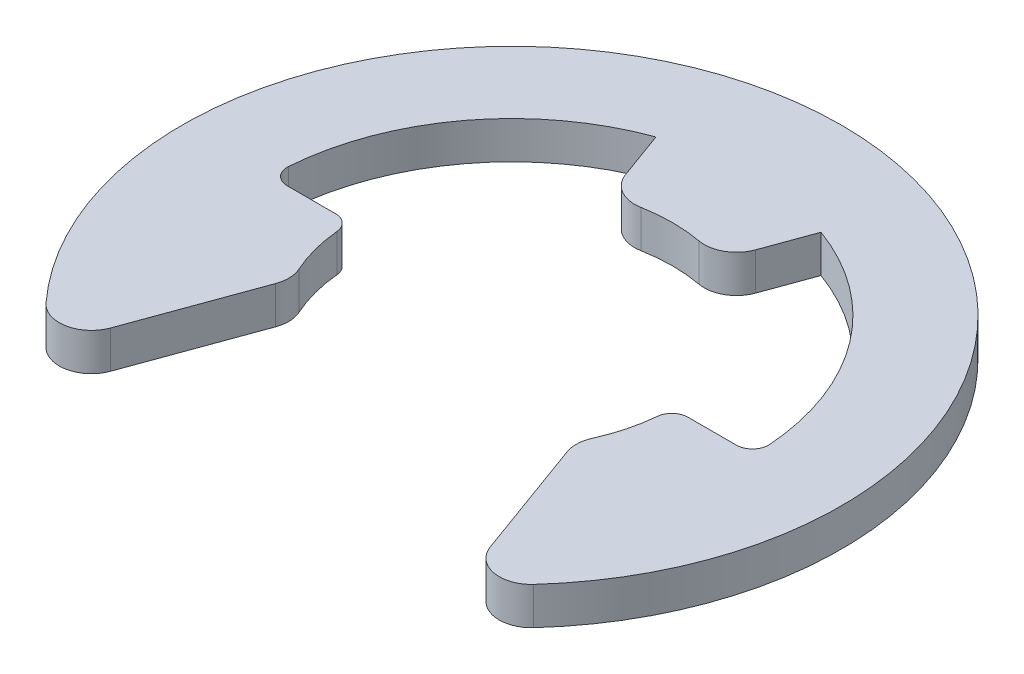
ISO-10303-21;
HEADER;
FILE_DESCRIPTION(('STEP AP214'),'2;1');
FILE_NAME('part.step','',(''),(''),'','','');
FILE_SCHEMA(('AUTOMOTIVE_DESIGN { 1 0 10303 214 1 1 1 1 }'));
ENDSEC;
DATA;
#1=APPLICATION_CONTEXT('core data for automotive mechanical design processes');
#2=APPLICATION_PROTOCOL_DEFINITION('international standard','automotive_design',2000,#1);
#3=PRODUCT_CONTEXT('',#1,'mechanical');
#4=PRODUCT('Part','Part','',(#3));
#5=PRODUCT_RELATED_PRODUCT_CATEGORY('part','',(#4));
#6=PRODUCT_DEFINITION_FORMATION('','',#4);
#7=PRODUCT_DEFINITION_CONTEXT('part definition',#1,'design');
#8=PRODUCT_DEFINITION('design','',#6,#7);
#9=PRODUCT_DEFINITION_SHAPE('','',#8);
#10=(LENGTH_UNIT() NAMED_UNIT(*) SI_UNIT(.MILLI.,.METRE.));
#11=(NAMED_UNIT(*) PLANE_ANGLE_UNIT() SI_UNIT($,.RADIAN.));
#12=(NAMED_UNIT(*) SI_UNIT($,.STERADIAN.) SOLID_ANGLE_UNIT());
#13=UNCERTAINTY_MEASURE_WITH_UNIT(LENGTH_MEASURE(1.E-05),#10,'distance_accuracy_value','');
#14=(GEOMETRIC_REPRESENTATION_CONTEXT(3) GLOBAL_UNCERTAINTY_ASSIGNED_CONTEXT((#13)) GLOBAL_UNIT_ASSIGNED_CONTEXT((#10,
#11,#12)) REPRESENTATION_CONTEXT('',''));
#15=CARTESIAN_POINT('',(0.,0.,0.));
#16=DIRECTION('',(0.,0.,1.));
#17=DIRECTION('',(1.,0.,0.));
#18=AXIS2_PLACEMENT_3D('',#15,#16,#17);
#19=CARTESIAN_POINT('',(0.,0.35,0.));
#20=DIRECTION('',(0.,-1.,0.));
#21=DIRECTION('',(0.,0.,-1.));
#22=AXIS2_PLACEMENT_3D('',#19,#20,#21);
#23=CYLINDRICAL_SURFACE('',#22,4.5);
#24=CARTESIAN_POINT('',(0.,0.35,0.));
#25=DIRECTION('',(0.,-1.,0.));
#26=DIRECTION('',(0.,0.,1.));
#27=AXIS2_PLACEMENT_3D('',#24,#25,#26);
#28=CIRCLE('',#27,4.5);
#29=CARTESIAN_POINT('',(-4.4885057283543,0.35,-0.321428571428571));
#30=VERTEX_POINT('',#29);
#31=CARTESIAN_POINT('',(-1.5390906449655,0.35,-4.22861679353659));
#32=VERTEX_POINT('',#31);
#33=EDGE_CURVE('E187',#30,#32,#28,.T.);
#34=ORIENTED_EDGE('',*,*,#33,.F.);
#35=DIRECTION('',(0.,-1.,0.));
#36=VECTOR('',#35,1.);
#37=CARTESIAN_POINT('',(-4.4885057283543,0.35,-0.321428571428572));
#38=LINE('',#37,#36);
#39=CARTESIAN_POINT('',(-4.4885057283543,-0.35,-0.321428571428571));
#40=VERTEX_POINT('',#39);
#41=EDGE_CURVE('E328',#30,#40,#38,.T.);
#42=ORIENTED_EDGE('',*,*,#41,.T.);
#43=CARTESIAN_POINT('',(0.,-0.35,0.));
#44=DIRECTION('',(0.,-1.,0.));
#45=DIRECTION('',(0.,0.,1.));
#46=AXIS2_PLACEMENT_3D('',#43,#44,#45);
#47=CIRCLE('',#46,4.5);
#48=CARTESIAN_POINT('',(-1.5390906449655,-0.35,-4.22861679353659));
#49=VERTEX_POINT('',#48);
#50=EDGE_CURVE('E211',#40,#49,#47,.T.);
#51=ORIENTED_EDGE('',*,*,#50,.T.);
#52=DIRECTION('',(0.,-1.,0.));
#53=VECTOR('',#52,1.);
#54=CARTESIAN_POINT('',(-1.5390906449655,0.35,-4.22861679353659));
#55=LINE('',#54,#53);
#56=EDGE_CURVE('E204',#32,#49,#55,.T.);
#57=ORIENTED_EDGE('',*,*,#56,.F.);
#58=EDGE_LOOP('',(#34,#42,#51,#57));
#59=FACE_BOUND('',#58,.T.);
#60=ADVANCED_FACE('F39',(#59),#23,.F.);
#61=CARTESIAN_POINT('',(-1.5390906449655,0.35,-4.22861679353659));
#62=DIRECTION('',(0.939692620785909,0.,-0.342020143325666));
#63=DIRECTION('',(-0.342020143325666,0.,-0.939692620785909));
#64=AXIS2_PLACEMENT_3D('',#61,#62,#63);
#65=PLANE('',#64);
#66=DIRECTION('',(0.342020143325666,0.,0.939692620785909));
#67=VECTOR('',#66,1.);
#68=CARTESIAN_POINT('',(-1.5390906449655,-0.35,-4.22861679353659));
#69=LINE('',#68,#67);
#70=CARTESIAN_POINT('',(-1.21405107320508,-0.35,-3.33557790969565));
#71=VERTEX_POINT('',#70);
#72=EDGE_CURVE('E448',#49,#71,#69,.T.);
#73=ORIENTED_EDGE('',*,*,#72,.T.);
#74=DIRECTION('',(0.,-1.,0.));
#75=VECTOR('',#74,1.);
#76=CARTESIAN_POINT('',(-1.21405107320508,0.35,-3.33557790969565));
#77=LINE('',#76,#75);
#78=CARTESIAN_POINT('',(-1.21405107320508,0.35,-3.33557790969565));
#79=VERTEX_POINT('',#78);
#80=EDGE_CURVE('E206',#71,#79,#77,.F.);
#81=ORIENTED_EDGE('',*,*,#80,.T.);
#82=DIRECTION('',(0.342020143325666,0.,0.939692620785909));
#83=VECTOR('',#82,1.);
#84=CARTESIAN_POINT('',(-1.5390906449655,0.35,-4.22861679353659));
#85=LINE('',#84,#83);
#86=EDGE_CURVE('E191',#32,#79,#85,.T.);
#87=ORIENTED_EDGE('',*,*,#86,.F.);
#88=ORIENTED_EDGE('',*,*,#56,.T.);
#89=EDGE_LOOP('',(#73,#81,#87,#88));
#90=FACE_BOUND('',#89,.T.);
#91=ADVANCED_FACE('F203',(#90),#65,.F.);
#92=CARTESIAN_POINT('',(0.,0.35,0.));
#93=DIRECTION('',(0.,-1.,0.));
#94=DIRECTION('',(0.,0.,-1.));
#95=AXIS2_PLACEMENT_3D('',#92,#93,#94);
#96=CYLINDRICAL_SURFACE('',#95,3.);
#97=CARTESIAN_POINT('',(0.,-0.35,0.));
#98=DIRECTION('',(0.,-1.,0.));
#99=DIRECTION('',(0.,0.,1.));
#100=AXIS2_PLACEMENT_3D('',#97,#98,#99);
#101=CIRCLE('',#100,3.);
#102=CARTESIAN_POINT('',(-0.541862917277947,-0.35,-2.95065832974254));
#103=VERTEX_POINT('',#102);
#104=CARTESIAN_POINT('',(0.541862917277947,-0.35,-2.95065832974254));
#105=VERTEX_POINT('',#104);
#106=EDGE_CURVE('E451',#103,#105,#101,.T.);
#107=ORIENTED_EDGE('',*,*,#106,.T.);
#108=DIRECTION('',(0.,-1.,0.));
#109=VECTOR('',#108,1.);
#110=CARTESIAN_POINT('',(0.541862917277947,0.35,-2.95065832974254));
#111=LINE('',#110,#109);
#112=CARTESIAN_POINT('',(0.541862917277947,0.35,-2.95065832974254));
#113=VERTEX_POINT('',#112);
#114=EDGE_CURVE('E290',#105,#113,#111,.F.);
#115=ORIENTED_EDGE('',*,*,#114,.T.);
#116=CARTESIAN_POINT('',(0.,0.35,0.));
#117=DIRECTION('',(0.,-1.,0.));
#118=DIRECTION('',(0.,0.,1.));
#119=AXIS2_PLACEMENT_3D('',#116,#117,#118);
#120=CIRCLE('',#119,3.);
#121=CARTESIAN_POINT('',(-0.541862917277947,0.35,-2.95065832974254));
#122=VERTEX_POINT('',#121);
#123=EDGE_CURVE('E208',#122,#113,#120,.T.);
#124=ORIENTED_EDGE('',*,*,#123,.F.);
#125=DIRECTION('',(0.,-1.,0.));
#126=VECTOR('',#125,1.);
#127=CARTESIAN_POINT('',(-0.541862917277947,0.35,-2.95065832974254));
#128=LINE('',#127,#126);
#129=EDGE_CURVE('E286',#122,#103,#128,.T.);
#130=ORIENTED_EDGE('',*,*,#129,.T.);
#131=EDGE_LOOP('',(#107,#115,#124,#130));
#132=FACE_BOUND('',#131,.T.);
#133=ADVANCED_FACE('F371',(#132),#96,.F.);
#134=CARTESIAN_POINT('',(1.026060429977,0.35,-2.81907786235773));
#135=DIRECTION('',(-0.939692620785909,0.,-0.342020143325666));
#136=DIRECTION('',(-0.342020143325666,0.,0.93969262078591));
#137=AXIS2_PLACEMENT_3D('',#134,#135,#136);
#138=PLANE('',#137);
#139=DIRECTION('',(0.342020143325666,0.,-0.939692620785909));
#140=VECTOR('',#139,1.);
#141=CARTESIAN_POINT('',(1.026060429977,0.35,-2.81907786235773));
#142=LINE('',#141,#140);
#143=CARTESIAN_POINT('',(1.21405107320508,0.35,-3.33557790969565));
#144=VERTEX_POINT('',#143);
#145=CARTESIAN_POINT('',(1.5390906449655,0.35,-4.22861679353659));
#146=VERTEX_POINT('',#145);
#147=EDGE_CURVE('E425',#144,#146,#142,.T.);
#148=ORIENTED_EDGE('',*,*,#147,.F.);
#149=DIRECTION('',(0.,-1.,0.));
#150=VECTOR('',#149,1.);
#151=CARTESIAN_POINT('',(1.21405107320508,0.35,-3.33557790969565));
#152=LINE('',#151,#150);
#153=CARTESIAN_POINT('',(1.21405107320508,-0.35,-3.33557790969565));
#154=VERTEX_POINT('',#153);
#155=EDGE_CURVE('E282',#144,#154,#152,.T.);
#156=ORIENTED_EDGE('',*,*,#155,.T.);
#157=DIRECTION('',(0.342020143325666,0.,-0.939692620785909));
#158=VECTOR('',#157,1.);
#159=CARTESIAN_POINT('',(1.026060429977,-0.35,-2.81907786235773));
#160=LINE('',#159,#158);
#161=CARTESIAN_POINT('',(1.5390906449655,-0.35,-4.22861679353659));
#162=VERTEX_POINT('',#161);
#163=EDGE_CURVE('E455',#154,#162,#160,.T.);
#164=ORIENTED_EDGE('',*,*,#163,.T.);
#165=DIRECTION('',(0.,-1.,0.));
#166=VECTOR('',#165,1.);
#167=CARTESIAN_POINT('',(1.5390906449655,0.35,-4.22861679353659));
#168=LINE('',#167,#166);
#169=EDGE_CURVE('E215',#146,#162,#168,.T.);
#170=ORIENTED_EDGE('',*,*,#169,.F.);
#171=EDGE_LOOP('',(#148,#156,#164,#170));
#172=FACE_BOUND('',#171,.T.);
#173=ADVANCED_FACE('F528',(#172),#138,.F.);
#174=CARTESIAN_POINT('',(0.,0.35,0.));
#175=DIRECTION('',(0.,-1.,0.));
#176=DIRECTION('',(0.,0.,-1.));
#177=AXIS2_PLACEMENT_3D('',#174,#175,#176);
#178=CYLINDRICAL_SURFACE('',#177,4.5);
#179=CARTESIAN_POINT('',(0.,-0.35,0.));
#180=DIRECTION('',(0.,-1.,0.));
#181=DIRECTION('',(0.,0.,1.));
#182=AXIS2_PLACEMENT_3D('',#179,#180,#181);
#183=CIRCLE('',#182,4.5);
#184=CARTESIAN_POINT('',(4.4885057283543,-0.35,-0.321428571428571));
#185=VERTEX_POINT('',#184);
#186=EDGE_CURVE('E457',#162,#185,#183,.T.);
#187=ORIENTED_EDGE('',*,*,#186,.T.);
#188=DIRECTION('',(0.,-1.,0.));
#189=VECTOR('',#188,1.);
#190=CARTESIAN_POINT('',(4.4885057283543,0.35,-0.321428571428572));
#191=LINE('',#190,#189);
#192=CARTESIAN_POINT('',(4.4885057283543,0.35,-0.321428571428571));
#193=VERTEX_POINT('',#192);
#194=EDGE_CURVE('E309',#185,#193,#191,.F.);
#195=ORIENTED_EDGE('',*,*,#194,.T.);
#196=CARTESIAN_POINT('',(0.,0.35,0.));
#197=DIRECTION('',(0.,-1.,0.));
#198=DIRECTION('',(0.,0.,1.));
#199=AXIS2_PLACEMENT_3D('',#196,#197,#198);
#200=CIRCLE('',#199,4.5);
#201=EDGE_CURVE('E411',#146,#193,#200,.T.);
#202=ORIENTED_EDGE('',*,*,#201,.F.);
#203=ORIENTED_EDGE('',*,*,#169,.T.);
#204=EDGE_LOOP('',(#187,#195,#202,#203));
#205=FACE_BOUND('',#204,.T.);
#206=ADVANCED_FACE('F522',(#205),#178,.F.);
#207=CARTESIAN_POINT('',(3.,0.35,0.));
#208=DIRECTION('',(0.,0.,1.));
#209=DIRECTION('',(1.,0.,0.));
#210=AXIS2_PLACEMENT_3D('',#207,#208,#209);
#211=PLANE('',#210);
#212=DIRECTION('',(-1.,0.,0.));
#213=VECTOR('',#212,1.);
#214=CARTESIAN_POINT('',(3.,0.35,0.));
#215=LINE('',#214,#213);
#216=CARTESIAN_POINT('',(4.18927201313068,0.35,0.));
#217=VERTEX_POINT('',#216);
#218=CARTESIAN_POINT('',(3.286335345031,0.35,0.));
#219=VERTEX_POINT('',#218);
#220=EDGE_CURVE('E408',#217,#219,#215,.T.);
#221=ORIENTED_EDGE('',*,*,#220,.F.);
#222=DIRECTION('',(0.,1.,0.));
#223=VECTOR('',#222,1.);
#224=CARTESIAN_POINT('',(4.18927201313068,-0.35,0.));
#225=LINE('',#224,#223);
#226=CARTESIAN_POINT('',(4.18927201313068,-0.35,0.));
#227=VERTEX_POINT('',#226);
#228=EDGE_CURVE('E305',#217,#227,#225,.F.);
#229=ORIENTED_EDGE('',*,*,#228,.T.);
#230=DIRECTION('',(-1.,0.,0.));
#231=VECTOR('',#230,1.);
#232=CARTESIAN_POINT('',(3.,-0.35,0.));
#233=LINE('',#232,#231);
#234=CARTESIAN_POINT('',(3.286335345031,-0.35,0.));
#235=VERTEX_POINT('',#234);
#236=EDGE_CURVE('E461',#227,#235,#233,.T.);
#237=ORIENTED_EDGE('',*,*,#236,.T.);
#238=DIRECTION('',(0.,-1.,0.));
#239=VECTOR('',#238,1.);
#240=CARTESIAN_POINT('',(3.286335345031,0.35,0.));
#241=LINE('',#240,#239);
#242=EDGE_CURVE('E302',#235,#219,#241,.F.);
#243=ORIENTED_EDGE('',*,*,#242,.T.);
#244=EDGE_LOOP('',(#221,#229,#237,#243));
#245=FACE_BOUND('',#244,.T.);
#246=ADVANCED_FACE('F413',(#245),#211,.F.);
#247=CARTESIAN_POINT('',(0.,0.35,0.));
#248=DIRECTION('',(0.,-1.,0.));
#249=DIRECTION('',(0.,0.,-1.));
#250=AXIS2_PLACEMENT_3D('',#247,#248,#249);
#251=CYLINDRICAL_SURFACE('',#250,3.);
#252=CARTESIAN_POINT('',(0.,0.35,0.));
#253=DIRECTION('',(0.,-1.,0.));
#254=DIRECTION('',(0.,0.,1.));
#255=AXIS2_PLACEMENT_3D('',#252,#253,#254);
#256=CIRCLE('',#255,3.);
#257=CARTESIAN_POINT('',(2.98757758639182,0.35,0.272727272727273));
#258=VERTEX_POINT('',#257);
#259=CARTESIAN_POINT('',(2.734829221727,0.35,1.23317035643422));
#260=VERTEX_POINT('',#259);
#261=EDGE_CURVE('E418',#258,#260,#256,.T.);
#262=ORIENTED_EDGE('',*,*,#261,.F.);
#263=DIRECTION('',(0.,-1.,0.));
#264=VECTOR('',#263,1.);
#265=CARTESIAN_POINT('',(2.98757758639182,0.35,0.272727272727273));
#266=LINE('',#265,#264);
#267=CARTESIAN_POINT('',(2.98757758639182,-0.35,0.272727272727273));
#268=VERTEX_POINT('',#267);
#269=EDGE_CURVE('E312',#258,#268,#266,.T.);
#270=ORIENTED_EDGE('',*,*,#269,.T.);
#271=CARTESIAN_POINT('',(0.,-0.35,0.));
#272=DIRECTION('',(0.,-1.,0.));
#273=DIRECTION('',(0.,0.,1.));
#274=AXIS2_PLACEMENT_3D('',#271,#272,#273);
#275=CIRCLE('',#274,3.);
#276=CARTESIAN_POINT('',(2.734829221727,-0.35,1.23317035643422));
#277=VERTEX_POINT('',#276);
#278=EDGE_CURVE('E464',#268,#277,#275,.T.);
#279=ORIENTED_EDGE('',*,*,#278,.T.);
#280=DIRECTION('',(0.,-1.,0.));
#281=VECTOR('',#280,1.);
#282=CARTESIAN_POINT('',(2.734829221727,0.35,1.23317035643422));
#283=LINE('',#282,#281);
#284=EDGE_CURVE('E250',#277,#260,#283,.F.);
#285=ORIENTED_EDGE('',*,*,#284,.T.);
#286=EDGE_LOOP('',(#262,#270,#279,#285));
#287=FACE_BOUND('',#286,.T.);
#288=ADVANCED_FACE('F513',(#287),#251,.F.);
#289=CARTESIAN_POINT('',(2.63,0.35,1.44329484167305));
#290=DIRECTION('',(0.939692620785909,0.,-0.342020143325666));
#291=DIRECTION('',(-0.342020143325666,0.,-0.939692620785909));
#292=AXIS2_PLACEMENT_3D('',#289,#290,#291);
#293=PLANE('',#292);
#294=DIRECTION('',(0.342020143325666,0.,0.939692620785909));
#295=VECTOR('',#294,1.);
#296=CARTESIAN_POINT('',(2.63,0.35,1.44329484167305));
#297=LINE('',#296,#295);
#298=CARTESIAN_POINT('',(2.71797949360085,0.35,1.68501651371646));
#299=VERTEX_POINT('',#298);
#300=CARTESIAN_POINT('',(3.53952710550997,0.35,3.94220002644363));
#301=VERTEX_POINT('',#300);
#302=EDGE_CURVE('E422',#299,#301,#297,.T.);
#303=ORIENTED_EDGE('',*,*,#302,.F.);
#304=DIRECTION('',(0.,-1.,0.));
#305=VECTOR('',#304,1.);
#306=CARTESIAN_POINT('',(2.71797949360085,0.35,1.68501651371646));
#307=LINE('',#306,#305);
#308=CARTESIAN_POINT('',(2.71797949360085,-0.35,1.68501651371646));
#309=VERTEX_POINT('',#308);
#310=EDGE_CURVE('E220',#299,#309,#307,.T.);
#311=ORIENTED_EDGE('',*,*,#310,.T.);
#312=DIRECTION('',(0.342020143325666,0.,0.939692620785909));
#313=VECTOR('',#312,1.);
#314=CARTESIAN_POINT('',(2.63,-0.35,1.44329484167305));
#315=LINE('',#314,#313);
#316=CARTESIAN_POINT('',(3.53952710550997,-0.35,3.94220002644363));
#317=VERTEX_POINT('',#316);
#318=EDGE_CURVE('E467',#309,#317,#315,.T.);
#319=ORIENTED_EDGE('',*,*,#318,.T.);
#320=DIRECTION('',(0.,-1.,0.));
#321=VECTOR('',#320,1.);
#322=CARTESIAN_POINT('',(3.53952710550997,0.35,3.94220002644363));
#323=LINE('',#322,#321);
#324=EDGE_CURVE('E214',#317,#301,#323,.F.);
#325=ORIENTED_EDGE('',*,*,#324,.T.);
#326=EDGE_LOOP('',(#303,#311,#319,#325));
#327=FACE_BOUND('',#326,.T.);
#328=ADVANCED_FACE('F507',(#327),#293,.F.);
#329=CARTESIAN_POINT('',(0.,0.35,0.));
#330=DIRECTION('',(0.,-1.,0.));
#331=DIRECTION('',(0.,0.,-1.));
#332=AXIS2_PLACEMENT_3D('',#329,#330,#331);
#333=CYLINDRICAL_SURFACE('',#332,6.15);
#334=CARTESIAN_POINT('',(0.,0.35,0.));
#335=DIRECTION('',(0.,1.,0.));
#336=DIRECTION('',(0.,0.,1.));
#337=AXIS2_PLACEMENT_3D('',#334,#335,#336);
#338=CIRCLE('',#337,6.15);
#339=CARTESIAN_POINT('',(4.54694729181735,0.35,4.14098663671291));
#340=VERTEX_POINT('',#339);
#341=CARTESIAN_POINT('',(-4.54694729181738,0.35,4.14098663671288));
#342=VERTEX_POINT('',#341);
#343=EDGE_CURVE('E432',#340,#342,#338,.T.);
#344=ORIENTED_EDGE('',*,*,#343,.F.);
#345=DIRECTION('',(0.,-1.,0.));
#346=VECTOR('',#345,1.);
#347=CARTESIAN_POINT('',(4.54694729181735,0.35,4.14098663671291));
#348=LINE('',#347,#346);
#349=CARTESIAN_POINT('',(4.54694729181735,-0.35,4.14098663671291));
#350=VERTEX_POINT('',#349);
#351=EDGE_CURVE('E298',#340,#350,#348,.T.);
#352=ORIENTED_EDGE('',*,*,#351,.T.);
#353=CARTESIAN_POINT('',(0.,-0.35,0.));
#354=DIRECTION('',(0.,1.,0.));
#355=DIRECTION('',(0.,0.,1.));
#356=AXIS2_PLACEMENT_3D('',#353,#354,#355);
#357=CIRCLE('',#356,6.15);
#358=CARTESIAN_POINT('',(-4.54694729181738,-0.35,4.14098663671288));
#359=VERTEX_POINT('',#358);
#360=EDGE_CURVE('E471',#350,#359,#357,.T.);
#361=ORIENTED_EDGE('',*,*,#360,.T.);
#362=DIRECTION('',(0.,-1.,0.));
#363=VECTOR('',#362,1.);
#364=CARTESIAN_POINT('',(-4.54694729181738,0.35,4.14098663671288));
#365=LINE('',#364,#363);
#366=EDGE_CURVE('E295',#359,#342,#365,.F.);
#367=ORIENTED_EDGE('',*,*,#366,.T.);
#368=EDGE_LOOP('',(#344,#352,#361,#367));
#369=FACE_BOUND('',#368,.T.);
#370=ADVANCED_FACE('F500',(#369),#333,.T.);
#371=CARTESIAN_POINT('',(-3.85017300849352,0.35,4.79569263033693));
#372=DIRECTION('',(-0.939692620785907,0.,-0.342020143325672));
#373=DIRECTION('',(-0.342020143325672,0.,0.939692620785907));
#374=AXIS2_PLACEMENT_3D('',#371,#372,#373);
#375=PLANE('',#374);
#376=DIRECTION('',(0.342020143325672,0.,-0.939692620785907));
#377=VECTOR('',#376,1.);
#378=CARTESIAN_POINT('',(-3.85017300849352,-0.35,4.79569263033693));
#379=LINE('',#378,#377);
#380=CARTESIAN_POINT('',(-3.53952710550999,-0.35,3.94220002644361));
#381=VERTEX_POINT('',#380);
#382=CARTESIAN_POINT('',(-2.71797949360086,-0.35,1.68501651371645));
#383=VERTEX_POINT('',#382);
#384=EDGE_CURVE('E475',#381,#383,#379,.T.);
#385=ORIENTED_EDGE('',*,*,#384,.T.);
#386=DIRECTION('',(0.,-1.,0.));
#387=VECTOR('',#386,1.);
#388=CARTESIAN_POINT('',(-2.71797949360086,0.35,1.68501651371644));
#389=LINE('',#388,#387);
#390=CARTESIAN_POINT('',(-2.71797949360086,0.35,1.68501651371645));
#391=VERTEX_POINT('',#390);
#392=EDGE_CURVE('E279',#383,#391,#389,.F.);
#393=ORIENTED_EDGE('',*,*,#392,.T.);
#394=DIRECTION('',(0.342020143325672,0.,-0.939692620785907));
#395=VECTOR('',#394,1.);
#396=CARTESIAN_POINT('',(-3.85017300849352,0.35,4.79569263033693));
#397=LINE('',#396,#395);
#398=CARTESIAN_POINT('',(-3.53952710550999,0.35,3.94220002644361));
#399=VERTEX_POINT('',#398);
#400=EDGE_CURVE('E436',#399,#391,#397,.T.);
#401=ORIENTED_EDGE('',*,*,#400,.F.);
#402=DIRECTION('',(0.,-1.,0.));
#403=VECTOR('',#402,1.);
#404=CARTESIAN_POINT('',(-3.53952710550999,0.35,3.94220002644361));
#405=LINE('',#404,#403);
#406=EDGE_CURVE('E275',#399,#381,#405,.T.);
#407=ORIENTED_EDGE('',*,*,#406,.T.);
#408=EDGE_LOOP('',(#385,#393,#401,#407));
#409=FACE_BOUND('',#408,.T.);
#410=ADVANCED_FACE('F492',(#409),#375,.F.);
#411=CARTESIAN_POINT('',(0.,0.35,0.));
#412=DIRECTION('',(0.,-1.,0.));
#413=DIRECTION('',(0.,0.,-1.));
#414=AXIS2_PLACEMENT_3D('',#411,#412,#413);
#415=CYLINDRICAL_SURFACE('',#414,3.);
#416=CARTESIAN_POINT('',(0.,-0.35,0.));
#417=DIRECTION('',(0.,-1.,0.));
#418=DIRECTION('',(0.,0.,1.));
#419=AXIS2_PLACEMENT_3D('',#416,#417,#418);
#420=CIRCLE('',#419,3.);
#421=CARTESIAN_POINT('',(-2.73482922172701,-0.35,1.2331703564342));
#422=VERTEX_POINT('',#421);
#423=CARTESIAN_POINT('',(-2.98757758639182,-0.35,0.272727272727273));
#424=VERTEX_POINT('',#423);
#425=EDGE_CURVE('E354',#422,#424,#420,.T.);
#426=ORIENTED_EDGE('',*,*,#425,.T.);
#427=DIRECTION('',(0.,-1.,0.));
#428=VECTOR('',#427,1.);
#429=CARTESIAN_POINT('',(-2.98757758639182,0.35,0.272727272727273));
#430=LINE('',#429,#428);
#431=CARTESIAN_POINT('',(-2.98757758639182,0.35,0.272727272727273));
#432=VERTEX_POINT('',#431);
#433=EDGE_CURVE('E337',#424,#432,#430,.F.);
#434=ORIENTED_EDGE('',*,*,#433,.T.);
#435=CARTESIAN_POINT('',(0.,0.35,0.));
#436=DIRECTION('',(0.,-1.,0.));
#437=DIRECTION('',(0.,0.,1.));
#438=AXIS2_PLACEMENT_3D('',#435,#436,#437);
#439=CIRCLE('',#438,3.);
#440=CARTESIAN_POINT('',(-2.73482922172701,0.35,1.2331703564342));
#441=VERTEX_POINT('',#440);
#442=EDGE_CURVE('E440',#441,#432,#439,.T.);
#443=ORIENTED_EDGE('',*,*,#442,.F.);
#444=DIRECTION('',(0.,-1.,0.));
#445=VECTOR('',#444,1.);
#446=CARTESIAN_POINT('',(-2.73482922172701,0.35,1.2331703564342));
#447=LINE('',#446,#445);
#448=EDGE_CURVE('E271',#441,#422,#447,.T.);
#449=ORIENTED_EDGE('',*,*,#448,.T.);
#450=EDGE_LOOP('',(#426,#434,#443,#449));
#451=FACE_BOUND('',#450,.T.);
#452=ADVANCED_FACE('F484',(#451),#415,.F.);
#453=CARTESIAN_POINT('',(-3.,0.35,0.));
#454=DIRECTION('',(0.,0.,1.));
#455=DIRECTION('',(1.,0.,0.));
#456=AXIS2_PLACEMENT_3D('',#453,#454,#455);
#457=PLANE('',#456);
#458=DIRECTION('',(-1.,0.,0.));
#459=VECTOR('',#458,1.);
#460=CARTESIAN_POINT('',(-3.,-0.35,0.));
#461=LINE('',#460,#459);
#462=CARTESIAN_POINT('',(-3.286335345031,-0.35,0.));
#463=VERTEX_POINT('',#462);
#464=CARTESIAN_POINT('',(-4.18927201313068,-0.35,0.));
#465=VERTEX_POINT('',#464);
#466=EDGE_CURVE('E198',#463,#465,#461,.T.);
#467=ORIENTED_EDGE('',*,*,#466,.T.);
#468=DIRECTION('',(0.,1.,0.));
#469=VECTOR('',#468,1.);
#470=CARTESIAN_POINT('',(-4.18927201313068,0.35,0.));
#471=LINE('',#470,#469);
#472=CARTESIAN_POINT('',(-4.18927201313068,0.35,0.));
#473=VERTEX_POINT('',#472);
#474=EDGE_CURVE('E61',#465,#473,#471,.T.);
#475=ORIENTED_EDGE('',*,*,#474,.T.);
#476=DIRECTION('',(-1.,0.,0.));
#477=VECTOR('',#476,1.);
#478=CARTESIAN_POINT('',(-3.,0.35,0.));
#479=LINE('',#478,#477);
#480=CARTESIAN_POINT('',(-3.286335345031,0.35,0.));
#481=VERTEX_POINT('',#480);
#482=EDGE_CURVE('E224',#481,#473,#479,.T.);
#483=ORIENTED_EDGE('',*,*,#482,.F.);
#484=DIRECTION('',(0.,-1.,0.));
#485=VECTOR('',#484,1.);
#486=CARTESIAN_POINT('',(-3.286335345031,0.35,0.));
#487=LINE('',#486,#485);
#488=EDGE_CURVE('E331',#481,#463,#487,.T.);
#489=ORIENTED_EDGE('',*,*,#488,.T.);
#490=EDGE_LOOP('',(#467,#475,#483,#489));
#491=FACE_BOUND('',#490,.T.);
#492=ADVANCED_FACE('F351',(#491),#457,.F.);
#493=CARTESIAN_POINT('',(0.,0.35,0.));
#494=DIRECTION('',(0.,1.,0.));
#495=DIRECTION('',(0.,0.,1.));
#496=AXIS2_PLACEMENT_3D('',#493,#494,#495);
#497=PLANE('',#496);
#498=ORIENTED_EDGE('',*,*,#220,.T.);
#499=CARTESIAN_POINT('',(3.286335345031,0.35,0.3));
#500=DIRECTION('',(0.,1.,0.));
#501=DIRECTION('',(0.,0.,1.));
#502=AXIS2_PLACEMENT_3D('',#499,#500,#501);
#503=CIRCLE('',#502,0.3);
#504=EDGE_CURVE('E325',#219,#258,#503,.T.);
#505=ORIENTED_EDGE('',*,*,#504,.T.);
#506=ORIENTED_EDGE('',*,*,#261,.T.);
#507=CARTESIAN_POINT('',(3.2817950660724,0.35,1.47980442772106));
#508=DIRECTION('',(0.,1.,0.));
#509=DIRECTION('',(0.,0.,1.));
#510=AXIS2_PLACEMENT_3D('',#507,#508,#509);
#511=CIRCLE('',#510,0.6);
#512=EDGE_CURVE('E268',#260,#299,#511,.T.);
#513=ORIENTED_EDGE('',*,*,#512,.T.);
#514=ORIENTED_EDGE('',*,*,#302,.T.);
#515=CARTESIAN_POINT('',(4.10334267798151,0.35,3.73698794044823));
#516=DIRECTION('',(0.,1.,0.));
#517=DIRECTION('',(0.,0.,1.));
#518=AXIS2_PLACEMENT_3D('',#515,#516,#517);
#519=CIRCLE('',#518,0.6);
#520=EDGE_CURVE('E257',#301,#340,#519,.T.);
#521=ORIENTED_EDGE('',*,*,#520,.T.);
#522=ORIENTED_EDGE('',*,*,#343,.T.);
#523=CARTESIAN_POINT('',(-4.10334267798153,0.35,3.73698794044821));
#524=DIRECTION('',(0.,1.,0.));
#525=DIRECTION('',(0.,0.,1.));
#526=AXIS2_PLACEMENT_3D('',#523,#524,#525);
#527=CIRCLE('',#526,0.6);
#528=EDGE_CURVE('E254',#342,#399,#527,.T.);
#529=ORIENTED_EDGE('',*,*,#528,.T.);
#530=ORIENTED_EDGE('',*,*,#400,.T.);
#531=CARTESIAN_POINT('',(-3.28179506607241,0.35,1.47980442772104));
#532=DIRECTION('',(0.,1.,0.));
#533=DIRECTION('',(0.,0.,1.));
#534=AXIS2_PLACEMENT_3D('',#531,#532,#533);
#535=CIRCLE('',#534,0.6);
#536=EDGE_CURVE('E266',#391,#441,#535,.T.);
#537=ORIENTED_EDGE('',*,*,#536,.T.);
#538=ORIENTED_EDGE('',*,*,#442,.T.);
#539=CARTESIAN_POINT('',(-3.286335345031,0.35,0.3));
#540=DIRECTION('',(0.,1.,0.));
#541=DIRECTION('',(0.,0.,1.));
#542=AXIS2_PLACEMENT_3D('',#539,#540,#541);
#543=CIRCLE('',#542,0.3);
#544=EDGE_CURVE('E322',#432,#481,#543,.T.);
#545=ORIENTED_EDGE('',*,*,#544,.T.);
#546=ORIENTED_EDGE('',*,*,#482,.T.);
#547=CARTESIAN_POINT('',(-4.18927201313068,0.35,-0.3));
#548=DIRECTION('',(0.,1.,0.));
#549=DIRECTION('',(0.,0.,1.));
#550=AXIS2_PLACEMENT_3D('',#547,#548,#549);
#551=CIRCLE('',#550,0.3);
#552=EDGE_CURVE('E11',#473,#30,#551,.F.);
#553=ORIENTED_EDGE('',*,*,#552,.T.);
#554=ORIENTED_EDGE('',*,*,#33,.T.);
#555=ORIENTED_EDGE('',*,*,#86,.T.);
#556=CARTESIAN_POINT('',(-0.650235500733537,0.35,-3.54078999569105));
#557=DIRECTION('',(0.,1.,0.));
#558=DIRECTION('',(0.,0.,1.));
#559=AXIS2_PLACEMENT_3D('',#556,#557,#558);
#560=CIRCLE('',#559,0.6);
#561=EDGE_CURVE('E260',#79,#122,#560,.T.);
#562=ORIENTED_EDGE('',*,*,#561,.T.);
#563=ORIENTED_EDGE('',*,*,#123,.T.);
#564=CARTESIAN_POINT('',(0.650235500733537,0.35,-3.54078999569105));
#565=DIRECTION('',(0.,1.,0.));
#566=DIRECTION('',(0.,0.,1.));
#567=AXIS2_PLACEMENT_3D('',#564,#565,#566);
#568=CIRCLE('',#567,0.6);
#569=EDGE_CURVE('E263',#113,#144,#568,.T.);
#570=ORIENTED_EDGE('',*,*,#569,.T.);
#571=ORIENTED_EDGE('',*,*,#147,.T.);
#572=ORIENTED_EDGE('',*,*,#201,.T.);
#573=CARTESIAN_POINT('',(4.18927201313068,0.35,-0.3));
#574=DIRECTION('',(0.,1.,0.));
#575=DIRECTION('',(0.,0.,1.));
#576=AXIS2_PLACEMENT_3D('',#573,#574,#575);
#577=CIRCLE('',#576,0.3);
#578=EDGE_CURVE('E343',#193,#217,#577,.F.);
#579=ORIENTED_EDGE('',*,*,#578,.T.);
#580=EDGE_LOOP('',(#498,#505,#506,#513,#514,#521,#522,#529,#530,#537,#538,#545,#546,#553,#554,
#555,#562,#563,#570,#571,#572,#579));
#581=FACE_BOUND('',#580,.T.);
#582=ADVANCED_FACE('F190',(#581),#497,.T.);
#583=CARTESIAN_POINT('',(0.,-0.35,0.));
#584=DIRECTION('',(0.,1.,0.));
#585=DIRECTION('',(0.,0.,1.));
#586=AXIS2_PLACEMENT_3D('',#583,#584,#585);
#587=PLANE('',#586);
#588=ORIENTED_EDGE('',*,*,#278,.F.);
#589=CARTESIAN_POINT('',(3.286335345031,-0.35,0.3));
#590=DIRECTION('',(0.,1.,0.));
#591=DIRECTION('',(0.,0.,1.));
#592=AXIS2_PLACEMENT_3D('',#589,#590,#591);
#593=CIRCLE('',#592,0.3);
#594=EDGE_CURVE('E319',#268,#235,#593,.F.);
#595=ORIENTED_EDGE('',*,*,#594,.T.);
#596=ORIENTED_EDGE('',*,*,#236,.F.);
#597=CARTESIAN_POINT('',(4.18927201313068,-0.35,-0.3));
#598=DIRECTION('',(0.,1.,0.));
#599=DIRECTION('',(0.,0.,1.));
#600=AXIS2_PLACEMENT_3D('',#597,#598,#599);
#601=CIRCLE('',#600,0.3);
#602=EDGE_CURVE('E340',#227,#185,#601,.T.);
#603=ORIENTED_EDGE('',*,*,#602,.T.);
#604=ORIENTED_EDGE('',*,*,#186,.F.);
#605=ORIENTED_EDGE('',*,*,#163,.F.);
#606=CARTESIAN_POINT('',(0.650235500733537,-0.35,-3.54078999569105));
#607=DIRECTION('',(0.,1.,0.));
#608=DIRECTION('',(0.,0.,1.));
#609=AXIS2_PLACEMENT_3D('',#606,#607,#608);
#610=CIRCLE('',#609,0.6);
#611=EDGE_CURVE('E240',#154,#105,#610,.F.);
#612=ORIENTED_EDGE('',*,*,#611,.T.);
#613=ORIENTED_EDGE('',*,*,#106,.F.);
#614=CARTESIAN_POINT('',(-0.650235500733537,-0.35,-3.54078999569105));
#615=DIRECTION('',(0.,1.,0.));
#616=DIRECTION('',(0.,0.,1.));
#617=AXIS2_PLACEMENT_3D('',#614,#615,#616);
#618=CIRCLE('',#617,0.6);
#619=EDGE_CURVE('E237',#103,#71,#618,.F.);
#620=ORIENTED_EDGE('',*,*,#619,.T.);
#621=ORIENTED_EDGE('',*,*,#72,.F.);
#622=ORIENTED_EDGE('',*,*,#50,.F.);
#623=CARTESIAN_POINT('',(-4.18927201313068,-0.35,-0.3));
#624=DIRECTION('',(0.,1.,0.));
#625=DIRECTION('',(0.,0.,1.));
#626=AXIS2_PLACEMENT_3D('',#623,#624,#625);
#627=CIRCLE('',#626,0.3);
#628=EDGE_CURVE('E48',#40,#465,#627,.T.);
#629=ORIENTED_EDGE('',*,*,#628,.T.);
#630=ORIENTED_EDGE('',*,*,#466,.F.);
#631=CARTESIAN_POINT('',(-3.286335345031,-0.35,0.3));
#632=DIRECTION('',(0.,1.,0.));
#633=DIRECTION('',(0.,0.,1.));
#634=AXIS2_PLACEMENT_3D('',#631,#632,#633);
#635=CIRCLE('',#634,0.3);
#636=EDGE_CURVE('E316',#463,#424,#635,.F.);
#637=ORIENTED_EDGE('',*,*,#636,.T.);
#638=ORIENTED_EDGE('',*,*,#425,.F.);
#639=CARTESIAN_POINT('',(-3.28179506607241,-0.35,1.47980442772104));
#640=DIRECTION('',(0.,1.,0.));
#641=DIRECTION('',(0.,0.,1.));
#642=AXIS2_PLACEMENT_3D('',#639,#640,#641);
#643=CIRCLE('',#642,0.6);
#644=EDGE_CURVE('E243',#422,#383,#643,.F.);
#645=ORIENTED_EDGE('',*,*,#644,.T.);
#646=ORIENTED_EDGE('',*,*,#384,.F.);
#647=CARTESIAN_POINT('',(-4.10334267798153,-0.35,3.73698794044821));
#648=DIRECTION('',(0.,1.,0.));
#649=DIRECTION('',(0.,0.,1.));
#650=AXIS2_PLACEMENT_3D('',#647,#648,#649);
#651=CIRCLE('',#650,0.6);
#652=EDGE_CURVE('E231',#381,#359,#651,.F.);
#653=ORIENTED_EDGE('',*,*,#652,.T.);
#654=ORIENTED_EDGE('',*,*,#360,.F.);
#655=CARTESIAN_POINT('',(4.10334267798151,-0.35,3.73698794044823));
#656=DIRECTION('',(0.,1.,0.));
#657=DIRECTION('',(0.,0.,1.));
#658=AXIS2_PLACEMENT_3D('',#655,#656,#657);
#659=CIRCLE('',#658,0.6);
#660=EDGE_CURVE('E234',#350,#317,#659,.F.);
#661=ORIENTED_EDGE('',*,*,#660,.T.);
#662=ORIENTED_EDGE('',*,*,#318,.F.);
#663=CARTESIAN_POINT('',(3.2817950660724,-0.35,1.47980442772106));
#664=DIRECTION('',(0.,1.,0.));
#665=DIRECTION('',(0.,0.,1.));
#666=AXIS2_PLACEMENT_3D('',#663,#664,#665);
#667=CIRCLE('',#666,0.6);
#668=EDGE_CURVE('E246',#309,#277,#667,.F.);
#669=ORIENTED_EDGE('',*,*,#668,.T.);
#670=EDGE_LOOP('',(#588,#595,#596,#603,#604,#605,#612,#613,#620,#621,#622,#629,#630,#637,#638,
#645,#646,#653,#654,#661,#662,#669));
#671=FACE_BOUND('',#670,.T.);
#672=ADVANCED_FACE('F349',(#671),#587,.F.);
#673=CARTESIAN_POINT('',(3.2817950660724,0.35,1.47980442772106));
#674=DIRECTION('',(0.,-1.,0.));
#675=DIRECTION('',(0.,0.,-1.));
#676=AXIS2_PLACEMENT_3D('',#673,#674,#675);
#677=CYLINDRICAL_SURFACE('',#676,0.6);
#678=ORIENTED_EDGE('',*,*,#512,.F.);
#679=ORIENTED_EDGE('',*,*,#284,.F.);
#680=ORIENTED_EDGE('',*,*,#668,.F.);
#681=ORIENTED_EDGE('',*,*,#310,.F.);
#682=EDGE_LOOP('',(#678,#679,#680,#681));
#683=FACE_BOUND('',#682,.T.);
#684=ADVANCED_FACE('F375',(#683),#677,.T.);
#685=CARTESIAN_POINT('',(-3.28179506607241,0.35,1.47980442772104));
#686=DIRECTION('',(0.,-1.,0.));
#687=DIRECTION('',(0.,0.,-1.));
#688=AXIS2_PLACEMENT_3D('',#685,#686,#687);
#689=CYLINDRICAL_SURFACE('',#688,0.6);
#690=ORIENTED_EDGE('',*,*,#536,.F.);
#691=ORIENTED_EDGE('',*,*,#392,.F.);
#692=ORIENTED_EDGE('',*,*,#644,.F.);
#693=ORIENTED_EDGE('',*,*,#448,.F.);
#694=EDGE_LOOP('',(#690,#691,#692,#693));
#695=FACE_BOUND('',#694,.T.);
#696=ADVANCED_FACE('F378',(#695),#689,.T.);
#697=CARTESIAN_POINT('',(0.650235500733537,0.35,-3.54078999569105));
#698=DIRECTION('',(0.,-1.,0.));
#699=DIRECTION('',(0.,0.,-1.));
#700=AXIS2_PLACEMENT_3D('',#697,#698,#699);
#701=CYLINDRICAL_SURFACE('',#700,0.6);
#702=ORIENTED_EDGE('',*,*,#569,.F.);
#703=ORIENTED_EDGE('',*,*,#114,.F.);
#704=ORIENTED_EDGE('',*,*,#611,.F.);
#705=ORIENTED_EDGE('',*,*,#155,.F.);
#706=EDGE_LOOP('',(#702,#703,#704,#705));
#707=FACE_BOUND('',#706,.T.);
#708=ADVANCED_FACE('F382',(#707),#701,.T.);
#709=CARTESIAN_POINT('',(-0.650235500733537,0.35,-3.54078999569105));
#710=DIRECTION('',(0.,-1.,0.));
#711=DIRECTION('',(0.,0.,-1.));
#712=AXIS2_PLACEMENT_3D('',#709,#710,#711);
#713=CYLINDRICAL_SURFACE('',#712,0.6);
#714=ORIENTED_EDGE('',*,*,#561,.F.);
#715=ORIENTED_EDGE('',*,*,#80,.F.);
#716=ORIENTED_EDGE('',*,*,#619,.F.);
#717=ORIENTED_EDGE('',*,*,#129,.F.);
#718=EDGE_LOOP('',(#714,#715,#716,#717));
#719=FACE_BOUND('',#718,.T.);
#720=ADVANCED_FACE('F386',(#719),#713,.T.);
#721=CARTESIAN_POINT('',(4.10334267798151,0.35,3.73698794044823));
#722=DIRECTION('',(0.,-1.,0.));
#723=DIRECTION('',(0.,0.,-1.));
#724=AXIS2_PLACEMENT_3D('',#721,#722,#723);
#725=CYLINDRICAL_SURFACE('',#724,0.6);
#726=ORIENTED_EDGE('',*,*,#520,.F.);
#727=ORIENTED_EDGE('',*,*,#324,.F.);
#728=ORIENTED_EDGE('',*,*,#660,.F.);
#729=ORIENTED_EDGE('',*,*,#351,.F.);
#730=EDGE_LOOP('',(#726,#727,#728,#729));
#731=FACE_BOUND('',#730,.T.);
#732=ADVANCED_FACE('F390',(#731),#725,.T.);
#733=CARTESIAN_POINT('',(-4.10334267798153,0.35,3.73698794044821));
#734=DIRECTION('',(0.,-1.,0.));
#735=DIRECTION('',(0.,0.,-1.));
#736=AXIS2_PLACEMENT_3D('',#733,#734,#735);
#737=CYLINDRICAL_SURFACE('',#736,0.6);
#738=ORIENTED_EDGE('',*,*,#528,.F.);
#739=ORIENTED_EDGE('',*,*,#366,.F.);
#740=ORIENTED_EDGE('',*,*,#652,.F.);
#741=ORIENTED_EDGE('',*,*,#406,.F.);
#742=EDGE_LOOP('',(#738,#739,#740,#741));
#743=FACE_BOUND('',#742,.T.);
#744=ADVANCED_FACE('F394',(#743),#737,.T.);
#745=CARTESIAN_POINT('',(4.18927201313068,0.35,-0.3));
#746=DIRECTION('',(0.,-1.,0.));
#747=DIRECTION('',(0.,0.,-1.));
#748=AXIS2_PLACEMENT_3D('',#745,#746,#747);
#749=CYLINDRICAL_SURFACE('',#748,0.3);
#750=ORIENTED_EDGE('',*,*,#578,.F.);
#751=ORIENTED_EDGE('',*,*,#194,.F.);
#752=ORIENTED_EDGE('',*,*,#602,.F.);
#753=ORIENTED_EDGE('',*,*,#228,.F.);
#754=EDGE_LOOP('',(#750,#751,#752,#753));
#755=FACE_BOUND('',#754,.T.);
#756=ADVANCED_FACE('F363',(#755),#749,.F.);
#757=CARTESIAN_POINT('',(3.286335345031,0.35,0.3));
#758=DIRECTION('',(0.,-1.,0.));
#759=DIRECTION('',(0.,0.,-1.));
#760=AXIS2_PLACEMENT_3D('',#757,#758,#759);
#761=CYLINDRICAL_SURFACE('',#760,0.3);
#762=ORIENTED_EDGE('',*,*,#504,.F.);
#763=ORIENTED_EDGE('',*,*,#242,.F.);
#764=ORIENTED_EDGE('',*,*,#594,.F.);
#765=ORIENTED_EDGE('',*,*,#269,.F.);
#766=EDGE_LOOP('',(#762,#763,#764,#765));
#767=FACE_BOUND('',#766,.T.);
#768=ADVANCED_FACE('F357',(#767),#761,.T.);
#769=CARTESIAN_POINT('',(-4.18927201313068,0.35,-0.3));
#770=DIRECTION('',(0.,-1.,0.));
#771=DIRECTION('',(0.,0.,-1.));
#772=AXIS2_PLACEMENT_3D('',#769,#770,#771);
#773=CYLINDRICAL_SURFACE('',#772,0.3);
#774=ORIENTED_EDGE('',*,*,#552,.F.);
#775=ORIENTED_EDGE('',*,*,#474,.F.);
#776=ORIENTED_EDGE('',*,*,#628,.F.);
#777=ORIENTED_EDGE('',*,*,#41,.F.);
#778=EDGE_LOOP('',(#774,#775,#776,#777));
#779=FACE_BOUND('',#778,.T.);
#780=ADVANCED_FACE('F355',(#779),#773,.F.);
#781=CARTESIAN_POINT('',(-3.286335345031,0.35,0.3));
#782=DIRECTION('',(0.,-1.,0.));
#783=DIRECTION('',(0.,0.,-1.));
#784=AXIS2_PLACEMENT_3D('',#781,#782,#783);
#785=CYLINDRICAL_SURFACE('',#784,0.3);
#786=ORIENTED_EDGE('',*,*,#544,.F.);
#787=ORIENTED_EDGE('',*,*,#433,.F.);
#788=ORIENTED_EDGE('',*,*,#636,.F.);
#789=ORIENTED_EDGE('',*,*,#488,.F.);
#790=EDGE_LOOP('',(#786,#787,#788,#789));
#791=FACE_BOUND('',#790,.T.);
#792=ADVANCED_FACE('F41',(#791),#785,.T.);
#793=CLOSED_SHELL('',(#60,#91,#133,#173,#206,#246,#288,#328,#370,#410,#452,#492,#582,#672,#684,
#696,#708,#720,#732,#744,#756,#768,#780,#792));
#794=MANIFOLD_SOLID_BREP('B2',#793);
#795=ADVANCED_BREP_SHAPE_REPRESENTATION('',(#18,#794),#14);
#796=SHAPE_DEFINITION_REPRESENTATION(#9,#795);
ENDSEC;
END-ISO-10303-21;
